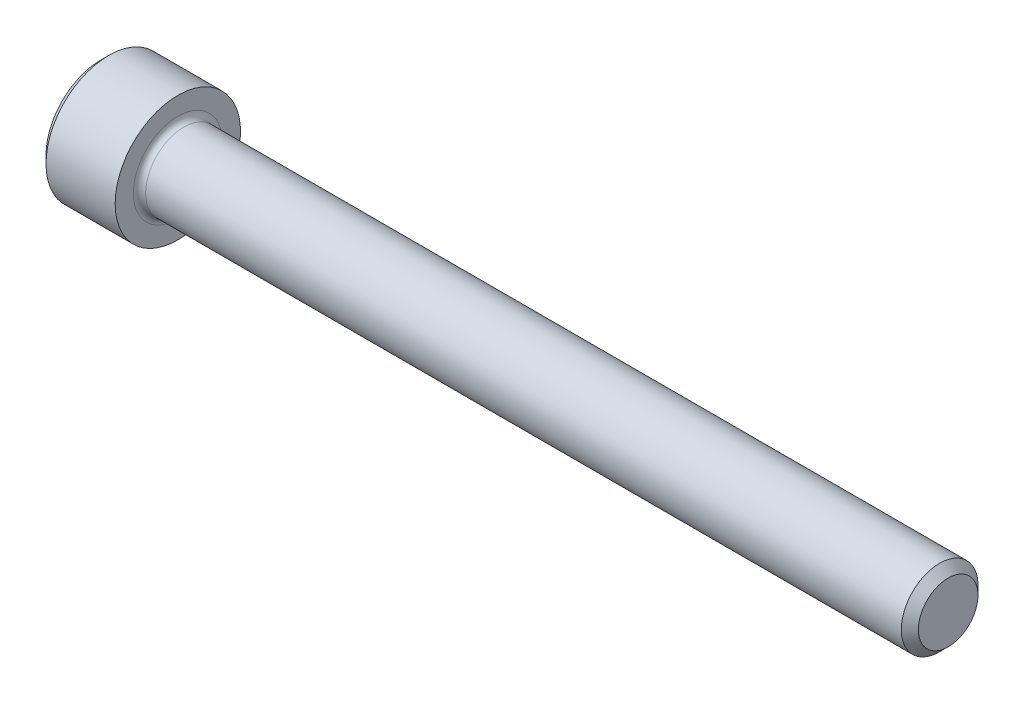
ISO-10303-21;
HEADER;
FILE_DESCRIPTION(('STEP AP214'),'2;1');
FILE_NAME('part.step','',(''),(''),'','','');
FILE_SCHEMA(('AUTOMOTIVE_DESIGN { 1 0 10303 214 1 1 1 1 }'));
ENDSEC;
DATA;
#1=APPLICATION_CONTEXT('core data for automotive mechanical design processes');
#2=APPLICATION_PROTOCOL_DEFINITION('international standard','automotive_design',2000,#1);
#3=PRODUCT_CONTEXT('',#1,'mechanical');
#4=PRODUCT('Part','Part','',(#3));
#5=PRODUCT_RELATED_PRODUCT_CATEGORY('part','',(#4));
#6=PRODUCT_DEFINITION_FORMATION('','',#4);
#7=PRODUCT_DEFINITION_CONTEXT('part definition',#1,'design');
#8=PRODUCT_DEFINITION('design','',#6,#7);
#9=PRODUCT_DEFINITION_SHAPE('','',#8);
#10=(LENGTH_UNIT() NAMED_UNIT(*) SI_UNIT(.MILLI.,.METRE.));
#11=(NAMED_UNIT(*) PLANE_ANGLE_UNIT() SI_UNIT($,.RADIAN.));
#12=(NAMED_UNIT(*) SI_UNIT($,.STERADIAN.) SOLID_ANGLE_UNIT());
#13=UNCERTAINTY_MEASURE_WITH_UNIT(LENGTH_MEASURE(1.E-05),#10,'distance_accuracy_value','');
#14=(GEOMETRIC_REPRESENTATION_CONTEXT(3) GLOBAL_UNCERTAINTY_ASSIGNED_CONTEXT((#13)) GLOBAL_UNIT_ASSIGNED_CONTEXT((#10,
#11,#12)) REPRESENTATION_CONTEXT('',''));
#15=CARTESIAN_POINT('',(0.,0.,0.));
#16=DIRECTION('',(0.,0.,1.));
#17=DIRECTION('',(1.,0.,0.));
#18=AXIS2_PLACEMENT_3D('',#15,#16,#17);
#19=CARTESIAN_POINT('',(0.,0.,0.));
#20=DIRECTION('',(-1.,0.,0.));
#21=DIRECTION('',(0.,0.,1.));
#22=AXIS2_PLACEMENT_3D('',#19,#20,#21);
#23=PLANE('',#22);
#24=DIRECTION('',(0.,-0.499999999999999,0.866025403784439));
#25=VECTOR('',#24,1.);
#26=CARTESIAN_POINT('',(0.,1.37848150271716,0.));
#27=LINE('',#26,#25);
#28=CARTESIAN_POINT('',(0.,1.37848150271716,0.));
#29=VERTEX_POINT('',#28);
#30=CARTESIAN_POINT('',(0.,0.689240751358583,1.1938));
#31=VERTEX_POINT('',#30);
#32=EDGE_CURVE('E258',#29,#31,#27,.T.);
#33=ORIENTED_EDGE('',*,*,#32,.T.);
#34=DIRECTION('',(0.,1.,0.));
#35=VECTOR('',#34,1.);
#36=CARTESIAN_POINT('',(0.,-0.689240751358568,1.1938));
#37=LINE('',#36,#35);
#38=CARTESIAN_POINT('',(0.,-0.689240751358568,1.1938));
#39=VERTEX_POINT('',#38);
#40=EDGE_CURVE('E129',#39,#31,#37,.T.);
#41=ORIENTED_EDGE('',*,*,#40,.F.);
#42=DIRECTION('',(0.,-0.500000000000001,-0.866025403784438));
#43=VECTOR('',#42,1.);
#44=CARTESIAN_POINT('',(0.,-0.689240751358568,1.1938));
#45=LINE('',#44,#43);
#46=CARTESIAN_POINT('',(0.,-1.37848150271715,0.));
#47=VERTEX_POINT('',#46);
#48=EDGE_CURVE('E261',#39,#47,#45,.T.);
#49=ORIENTED_EDGE('',*,*,#48,.T.);
#50=DIRECTION('',(0.,0.499999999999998,-0.86602540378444));
#51=VECTOR('',#50,1.);
#52=CARTESIAN_POINT('',(0.,-1.37848150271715,0.));
#53=LINE('',#52,#51);
#54=CARTESIAN_POINT('',(0.,-0.689240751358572,-1.1938));
#55=VERTEX_POINT('',#54);
#56=EDGE_CURVE('E264',#47,#55,#53,.T.);
#57=ORIENTED_EDGE('',*,*,#56,.T.);
#58=DIRECTION('',(0.,-1.,0.));
#59=VECTOR('',#58,1.);
#60=CARTESIAN_POINT('',(0.,0.689240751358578,-1.1938));
#61=LINE('',#60,#59);
#62=CARTESIAN_POINT('',(0.,0.689240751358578,-1.1938));
#63=VERTEX_POINT('',#62);
#64=EDGE_CURVE('E267',#63,#55,#61,.T.);
#65=ORIENTED_EDGE('',*,*,#64,.F.);
#66=DIRECTION('',(0.,-0.500000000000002,-0.866025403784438));
#67=VECTOR('',#66,1.);
#68=CARTESIAN_POINT('',(0.,1.37848150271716,0.));
#69=LINE('',#68,#67);
#70=EDGE_CURVE('E124',#29,#63,#69,.T.);
#71=ORIENTED_EDGE('',*,*,#70,.F.);
#72=EDGE_LOOP('',(#33,#41,#49,#57,#65,#71));
#73=FACE_BOUND('',#72,.T.);
#74=CARTESIAN_POINT('',(0.,0.,0.));
#75=DIRECTION('',(-1.,0.,0.));
#76=DIRECTION('',(0.,0.,1.));
#77=AXIS2_PLACEMENT_3D('',#74,#75,#76);
#78=CIRCLE('',#77,2.0447);
#79=CARTESIAN_POINT('',(0.,0.,2.0447));
#80=VERTEX_POINT('',#79);
#81=EDGE_CURVE('E153',#80,#80,#78,.T.);
#82=ORIENTED_EDGE('',*,*,#81,.T.);
#83=EDGE_LOOP('',(#82));
#84=FACE_BOUND('',#83,.T.);
#85=ADVANCED_FACE('F33',(#73,#84),#23,.T.);
#86=CARTESIAN_POINT('',(0.,0.,0.));
#87=DIRECTION('',(1.,0.,0.));
#88=DIRECTION('',(0.,0.,-1.));
#89=AXIS2_PLACEMENT_3D('',#86,#87,#88);
#90=CONICAL_SURFACE('',#89,2.0447,0.785398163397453);
#91=CARTESIAN_POINT('',(0.279399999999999,0.,0.));
#92=DIRECTION('',(-1.,0.,0.));
#93=DIRECTION('',(0.,0.,1.));
#94=AXIS2_PLACEMENT_3D('',#91,#92,#93);
#95=CIRCLE('',#94,2.3241);
#96=CARTESIAN_POINT('',(0.279399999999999,0.,2.3241));
#97=VERTEX_POINT('',#96);
#98=EDGE_CURVE('E150',#97,#97,#95,.T.);
#99=ORIENTED_EDGE('',*,*,#98,.T.);
#100=EDGE_LOOP('',(#99));
#101=FACE_BOUND('',#100,.T.);
#102=ORIENTED_EDGE('',*,*,#81,.F.);
#103=EDGE_LOOP('',(#102));
#104=FACE_BOUND('',#103,.T.);
#105=ADVANCED_FACE('F174',(#101,#104),#90,.T.);
#106=CARTESIAN_POINT('',(-31.75,0.,0.));
#107=DIRECTION('',(-1.,0.,0.));
#108=DIRECTION('',(0.,0.,1.));
#109=AXIS2_PLACEMENT_3D('',#106,#107,#108);
#110=CYLINDRICAL_SURFACE('',#109,2.3241);
#111=CARTESIAN_POINT('',(2.8448,0.,0.));
#112=DIRECTION('',(-1.,0.,0.));
#113=DIRECTION('',(0.,0.,1.));
#114=AXIS2_PLACEMENT_3D('',#111,#112,#113);
#115=CIRCLE('',#114,2.3241);
#116=CARTESIAN_POINT('',(2.8448,0.,2.3241));
#117=VERTEX_POINT('',#116);
#118=EDGE_CURVE('E147',#117,#117,#115,.T.);
#119=ORIENTED_EDGE('',*,*,#118,.T.);
#120=EDGE_LOOP('',(#119));
#121=FACE_BOUND('',#120,.T.);
#122=ORIENTED_EDGE('',*,*,#98,.F.);
#123=EDGE_LOOP('',(#122));
#124=FACE_BOUND('',#123,.T.);
#125=ADVANCED_FACE('F179',(#121,#124),#110,.T.);
#126=CARTESIAN_POINT('',(2.8448,2.3241,0.));
#127=DIRECTION('',(1.,0.,0.));
#128=DIRECTION('',(0.,0.,-1.));
#129=AXIS2_PLACEMENT_3D('',#126,#127,#128);
#130=PLANE('',#129);
#131=CARTESIAN_POINT('',(2.8448,0.,0.));
#132=DIRECTION('',(1.,0.,0.));
#133=DIRECTION('',(0.,0.,-1.));
#134=AXIS2_PLACEMENT_3D('',#131,#132,#133);
#135=CIRCLE('',#134,1.651);
#136=CARTESIAN_POINT('',(2.8448,0.,-1.651));
#137=VERTEX_POINT('',#136);
#138=EDGE_CURVE('E41',#137,#137,#135,.F.);
#139=ORIENTED_EDGE('',*,*,#138,.T.);
#140=EDGE_LOOP('',(#139));
#141=FACE_BOUND('',#140,.T.);
#142=ORIENTED_EDGE('',*,*,#118,.F.);
#143=EDGE_LOOP('',(#142));
#144=FACE_BOUND('',#143,.T.);
#145=ADVANCED_FACE('F158',(#141,#144),#130,.T.);
#146=CARTESIAN_POINT('',(-31.75,0.,0.));
#147=DIRECTION('',(-1.,0.,0.));
#148=DIRECTION('',(0.,0.,1.));
#149=AXIS2_PLACEMENT_3D('',#146,#147,#148);
#150=CYLINDRICAL_SURFACE('',#149,1.4224);
#151=CARTESIAN_POINT('',(3.0734,0.,0.));
#152=DIRECTION('',(1.,0.,0.));
#153=DIRECTION('',(0.,0.,-1.));
#154=AXIS2_PLACEMENT_3D('',#151,#152,#153);
#155=CIRCLE('',#154,1.4224);
#156=CARTESIAN_POINT('',(3.0734,0.,-1.4224));
#157=VERTEX_POINT('',#156);
#158=EDGE_CURVE('E11',#157,#157,#155,.T.);
#159=ORIENTED_EDGE('',*,*,#158,.T.);
#160=EDGE_LOOP('',(#159));
#161=FACE_BOUND('',#160,.T.);
#162=CARTESIAN_POINT('',(31.10357,0.,0.));
#163=DIRECTION('',(-1.,0.,0.));
#164=DIRECTION('',(0.,0.,1.));
#165=AXIS2_PLACEMENT_3D('',#162,#163,#164);
#166=CIRCLE('',#165,1.4224);
#167=CARTESIAN_POINT('',(31.10357,0.,1.4224));
#168=VERTEX_POINT('',#167);
#169=EDGE_CURVE('E144',#168,#168,#166,.T.);
#170=ORIENTED_EDGE('',*,*,#169,.T.);
#171=EDGE_LOOP('',(#170));
#172=FACE_BOUND('',#171,.T.);
#173=ADVANCED_FACE('F189',(#161,#172),#150,.T.);
#174=CARTESIAN_POINT('',(31.4198,0.,0.));
#175=DIRECTION('',(-1.,0.,0.));
#176=DIRECTION('',(0.,0.,1.));
#177=AXIS2_PLACEMENT_3D('',#174,#175,#176);
#178=CONICAL_SURFACE('',#177,1.10617,0.785398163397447);
#179=ORIENTED_EDGE('',*,*,#169,.F.);
#180=EDGE_LOOP('',(#179));
#181=FACE_BOUND('',#180,.T.);
#182=CARTESIAN_POINT('',(31.4198,0.,0.));
#183=DIRECTION('',(-1.,0.,0.));
#184=DIRECTION('',(0.,0.,1.));
#185=AXIS2_PLACEMENT_3D('',#182,#183,#184);
#186=CIRCLE('',#185,1.10617);
#187=CARTESIAN_POINT('',(31.4198,0.,1.10617));
#188=VERTEX_POINT('',#187);
#189=EDGE_CURVE('E140',#188,#188,#186,.T.);
#190=ORIENTED_EDGE('',*,*,#189,.T.);
#191=EDGE_LOOP('',(#190));
#192=FACE_BOUND('',#191,.T.);
#193=ADVANCED_FACE('F169',(#181,#192),#178,.T.);
#194=CARTESIAN_POINT('',(31.4198,1.10617,0.));
#195=DIRECTION('',(1.,0.,0.));
#196=DIRECTION('',(0.,0.,-1.));
#197=AXIS2_PLACEMENT_3D('',#194,#195,#196);
#198=PLANE('',#197);
#199=ORIENTED_EDGE('',*,*,#189,.F.);
#200=EDGE_LOOP('',(#199));
#201=FACE_BOUND('',#200,.T.);
#202=ADVANCED_FACE('F162',(#201),#198,.T.);
#203=CARTESIAN_POINT('',(3.0734,0.,0.));
#204=DIRECTION('',(1.,0.,0.));
#205=DIRECTION('',(0.,0.,-1.));
#206=AXIS2_PLACEMENT_3D('',#203,#204,#205);
#207=TOROIDAL_SURFACE('',#206,1.651,0.2286);
#208=ORIENTED_EDGE('',*,*,#158,.F.);
#209=EDGE_LOOP('',(#208));
#210=FACE_BOUND('',#209,.T.);
#211=ORIENTED_EDGE('',*,*,#138,.F.);
#212=EDGE_LOOP('',(#211));
#213=FACE_BOUND('',#212,.T.);
#214=ADVANCED_FACE('F35',(#210,#213),#207,.F.);
#215=CARTESIAN_POINT('',(1.2954,1.37848150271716,0.));
#216=DIRECTION('',(0.,-0.866025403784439,-0.499999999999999));
#217=DIRECTION('',(0.,0.499999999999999,-0.866025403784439));
#218=AXIS2_PLACEMENT_3D('',#215,#216,#217);
#219=PLANE('',#218);
#220=ORIENTED_EDGE('',*,*,#32,.F.);
#221=DIRECTION('',(-1.,0.,0.));
#222=VECTOR('',#221,1.);
#223=CARTESIAN_POINT('',(1.2954,1.37848150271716,0.));
#224=LINE('',#223,#222);
#225=CARTESIAN_POINT('',(1.2954,1.37848150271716,0.));
#226=VERTEX_POINT('',#225);
#227=EDGE_CURVE('E248',#226,#29,#224,.T.);
#228=ORIENTED_EDGE('',*,*,#227,.F.);
#229=DIRECTION('',(0.,-0.499999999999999,0.866025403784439));
#230=VECTOR('',#229,1.);
#231=CARTESIAN_POINT('',(1.2954,1.37848150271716,0.));
#232=LINE('',#231,#230);
#233=CARTESIAN_POINT('',(1.2954,1.03386112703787,0.5969));
#234=VERTEX_POINT('',#233);
#235=EDGE_CURVE('E116',#226,#234,#232,.T.);
#236=ORIENTED_EDGE('',*,*,#235,.T.);
#237=CARTESIAN_POINT('',(1.2954,0.689240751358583,1.1938));
#238=VERTEX_POINT('',#237);
#239=EDGE_CURVE('E107',#234,#238,#232,.T.);
#240=ORIENTED_EDGE('',*,*,#239,.T.);
#241=DIRECTION('',(-1.,0.,0.));
#242=VECTOR('',#241,1.);
#243=CARTESIAN_POINT('',(1.2954,0.689240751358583,1.1938));
#244=LINE('',#243,#242);
#245=EDGE_CURVE('E121',#238,#31,#244,.T.);
#246=ORIENTED_EDGE('',*,*,#245,.T.);
#247=EDGE_LOOP('',(#220,#228,#236,#240,#246));
#248=FACE_BOUND('',#247,.T.);
#249=ADVANCED_FACE('F120',(#248),#219,.T.);
#250=CARTESIAN_POINT('',(1.2954,-0.689240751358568,1.1938));
#251=DIRECTION('',(0.,0.,1.));
#252=DIRECTION('',(0.,-1.,0.));
#253=AXIS2_PLACEMENT_3D('',#250,#251,#252);
#254=PLANE('',#253);
#255=ORIENTED_EDGE('',*,*,#40,.T.);
#256=ORIENTED_EDGE('',*,*,#245,.F.);
#257=DIRECTION('',(0.,1.,0.));
#258=VECTOR('',#257,1.);
#259=CARTESIAN_POINT('',(1.2954,-0.689240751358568,1.1938));
#260=LINE('',#259,#258);
#261=CARTESIAN_POINT('',(1.2954,0.,1.1938));
#262=VERTEX_POINT('',#261);
#263=EDGE_CURVE('E104',#262,#238,#260,.T.);
#264=ORIENTED_EDGE('',*,*,#263,.F.);
#265=CARTESIAN_POINT('',(1.2954,-0.689240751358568,1.1938));
#266=VERTEX_POINT('',#265);
#267=EDGE_CURVE('E115',#266,#262,#260,.T.);
#268=ORIENTED_EDGE('',*,*,#267,.F.);
#269=DIRECTION('',(-1.,0.,0.));
#270=VECTOR('',#269,1.);
#271=CARTESIAN_POINT('',(1.2954,-0.689240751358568,1.1938));
#272=LINE('',#271,#270);
#273=EDGE_CURVE('E131',#266,#39,#272,.T.);
#274=ORIENTED_EDGE('',*,*,#273,.T.);
#275=EDGE_LOOP('',(#255,#256,#264,#268,#274));
#276=FACE_BOUND('',#275,.T.);
#277=ADVANCED_FACE('F126',(#276),#254,.F.);
#278=CARTESIAN_POINT('',(1.2954,-0.689240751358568,1.1938));
#279=DIRECTION('',(0.,0.866025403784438,-0.500000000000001));
#280=DIRECTION('',(0.,0.500000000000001,0.866025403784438));
#281=AXIS2_PLACEMENT_3D('',#278,#279,#280);
#282=PLANE('',#281);
#283=ORIENTED_EDGE('',*,*,#48,.F.);
#284=ORIENTED_EDGE('',*,*,#273,.F.);
#285=DIRECTION('',(0.,-0.500000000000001,-0.866025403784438));
#286=VECTOR('',#285,1.);
#287=CARTESIAN_POINT('',(1.2954,-0.689240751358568,1.1938));
#288=LINE('',#287,#286);
#289=CARTESIAN_POINT('',(1.2954,-1.03386112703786,0.596899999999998));
#290=VERTEX_POINT('',#289);
#291=EDGE_CURVE('E287',#266,#290,#288,.T.);
#292=ORIENTED_EDGE('',*,*,#291,.T.);
#293=CARTESIAN_POINT('',(1.2954,-1.37848150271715,0.));
#294=VERTEX_POINT('',#293);
#295=EDGE_CURVE('E276',#290,#294,#288,.T.);
#296=ORIENTED_EDGE('',*,*,#295,.T.);
#297=DIRECTION('',(-1.,0.,0.));
#298=VECTOR('',#297,1.);
#299=CARTESIAN_POINT('',(1.2954,-1.37848150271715,0.));
#300=LINE('',#299,#298);
#301=EDGE_CURVE('E136',#294,#47,#300,.T.);
#302=ORIENTED_EDGE('',*,*,#301,.T.);
#303=EDGE_LOOP('',(#283,#284,#292,#296,#302));
#304=FACE_BOUND('',#303,.T.);
#305=ADVANCED_FACE('F202',(#304),#282,.T.);
#306=CARTESIAN_POINT('',(1.2954,-1.37848150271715,0.));
#307=DIRECTION('',(0.,0.86602540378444,0.499999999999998));
#308=DIRECTION('',(0.,-0.499999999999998,0.86602540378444));
#309=AXIS2_PLACEMENT_3D('',#306,#307,#308);
#310=PLANE('',#309);
#311=ORIENTED_EDGE('',*,*,#56,.F.);
#312=ORIENTED_EDGE('',*,*,#301,.F.);
#313=DIRECTION('',(0.,0.499999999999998,-0.86602540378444));
#314=VECTOR('',#313,1.);
#315=CARTESIAN_POINT('',(1.2954,-1.37848150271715,0.));
#316=LINE('',#315,#314);
#317=CARTESIAN_POINT('',(1.2954,-1.03386112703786,-0.596899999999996));
#318=VERTEX_POINT('',#317);
#319=EDGE_CURVE('E254',#294,#318,#316,.T.);
#320=ORIENTED_EDGE('',*,*,#319,.T.);
#321=CARTESIAN_POINT('',(1.2954,-0.689240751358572,-1.1938));
#322=VERTEX_POINT('',#321);
#323=EDGE_CURVE('E286',#318,#322,#316,.T.);
#324=ORIENTED_EDGE('',*,*,#323,.T.);
#325=DIRECTION('',(-1.,0.,0.));
#326=VECTOR('',#325,1.);
#327=CARTESIAN_POINT('',(1.2954,-0.689240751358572,-1.1938));
#328=LINE('',#327,#326);
#329=EDGE_CURVE('E247',#322,#55,#328,.T.);
#330=ORIENTED_EDGE('',*,*,#329,.T.);
#331=EDGE_LOOP('',(#311,#312,#320,#324,#330));
#332=FACE_BOUND('',#331,.T.);
#333=ADVANCED_FACE('F205',(#332),#310,.T.);
#334=CARTESIAN_POINT('',(1.2954,0.689240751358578,-1.1938));
#335=DIRECTION('',(0.,0.,-1.));
#336=DIRECTION('',(0.,1.,0.));
#337=AXIS2_PLACEMENT_3D('',#334,#335,#336);
#338=PLANE('',#337);
#339=ORIENTED_EDGE('',*,*,#64,.T.);
#340=ORIENTED_EDGE('',*,*,#329,.F.);
#341=DIRECTION('',(0.,-1.,0.));
#342=VECTOR('',#341,1.);
#343=CARTESIAN_POINT('',(1.2954,0.689240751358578,-1.1938));
#344=LINE('',#343,#342);
#345=CARTESIAN_POINT('',(1.2954,0.,-1.1938));
#346=VERTEX_POINT('',#345);
#347=EDGE_CURVE('E251',#346,#322,#344,.T.);
#348=ORIENTED_EDGE('',*,*,#347,.F.);
#349=CARTESIAN_POINT('',(1.2954,0.689240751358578,-1.1938));
#350=VERTEX_POINT('',#349);
#351=EDGE_CURVE('E48',#350,#346,#344,.T.);
#352=ORIENTED_EDGE('',*,*,#351,.F.);
#353=DIRECTION('',(-1.,0.,0.));
#354=VECTOR('',#353,1.);
#355=CARTESIAN_POINT('',(1.2954,0.689240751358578,-1.1938));
#356=LINE('',#355,#354);
#357=EDGE_CURVE('E244',#350,#63,#356,.T.);
#358=ORIENTED_EDGE('',*,*,#357,.T.);
#359=EDGE_LOOP('',(#339,#340,#348,#352,#358));
#360=FACE_BOUND('',#359,.T.);
#361=ADVANCED_FACE('F209',(#360),#338,.F.);
#362=CARTESIAN_POINT('',(1.2954,1.37848150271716,0.));
#363=DIRECTION('',(0.,0.866025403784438,-0.500000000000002));
#364=DIRECTION('',(0.,0.500000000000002,0.866025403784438));
#365=AXIS2_PLACEMENT_3D('',#362,#363,#364);
#366=PLANE('',#365);
#367=ORIENTED_EDGE('',*,*,#70,.T.);
#368=ORIENTED_EDGE('',*,*,#357,.F.);
#369=DIRECTION('',(0.,-0.500000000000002,-0.866025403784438));
#370=VECTOR('',#369,1.);
#371=CARTESIAN_POINT('',(1.2954,1.37848150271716,0.));
#372=LINE('',#371,#370);
#373=CARTESIAN_POINT('',(1.2954,1.03386112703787,-0.596900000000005));
#374=VERTEX_POINT('',#373);
#375=EDGE_CURVE('E234',#374,#350,#372,.T.);
#376=ORIENTED_EDGE('',*,*,#375,.F.);
#377=EDGE_CURVE('E240',#226,#374,#372,.T.);
#378=ORIENTED_EDGE('',*,*,#377,.F.);
#379=ORIENTED_EDGE('',*,*,#227,.T.);
#380=EDGE_LOOP('',(#367,#368,#376,#378,#379));
#381=FACE_BOUND('',#380,.T.);
#382=ADVANCED_FACE('F213',(#381),#366,.F.);
#383=CARTESIAN_POINT('',(1.2954,2.06772225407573,-1.1938));
#384=DIRECTION('',(1.,0.,0.));
#385=DIRECTION('',(0.,0.,-1.));
#386=AXIS2_PLACEMENT_3D('',#383,#384,#385);
#387=PLANE('',#386);
#388=ORIENTED_EDGE('',*,*,#347,.T.);
#389=ORIENTED_EDGE('',*,*,#323,.F.);
#390=CARTESIAN_POINT('',(1.2954,0.,0.));
#391=DIRECTION('',(-1.,0.,0.));
#392=DIRECTION('',(0.,0.,1.));
#393=AXIS2_PLACEMENT_3D('',#390,#391,#392);
#394=CIRCLE('',#393,1.1938);
#395=EDGE_CURVE('E282',#346,#318,#394,.T.);
#396=ORIENTED_EDGE('',*,*,#395,.F.);
#397=EDGE_LOOP('',(#388,#389,#396));
#398=FACE_BOUND('',#397,.T.);
#399=ADVANCED_FACE('F217',(#398),#387,.F.);
#400=ORIENTED_EDGE('',*,*,#319,.F.);
#401=ORIENTED_EDGE('',*,*,#295,.F.);
#402=EDGE_CURVE('E134',#318,#290,#394,.T.);
#403=ORIENTED_EDGE('',*,*,#402,.F.);
#404=EDGE_LOOP('',(#400,#401,#403));
#405=FACE_BOUND('',#404,.T.);
#406=ADVANCED_FACE('F220',(#405),#387,.F.);
#407=ORIENTED_EDGE('',*,*,#291,.F.);
#408=ORIENTED_EDGE('',*,*,#267,.T.);
#409=EDGE_CURVE('E130',#290,#262,#394,.T.);
#410=ORIENTED_EDGE('',*,*,#409,.F.);
#411=EDGE_LOOP('',(#407,#408,#410));
#412=FACE_BOUND('',#411,.T.);
#413=ADVANCED_FACE('F225',(#412),#387,.F.);
#414=ORIENTED_EDGE('',*,*,#263,.T.);
#415=ORIENTED_EDGE('',*,*,#239,.F.);
#416=EDGE_CURVE('E110',#262,#234,#394,.T.);
#417=ORIENTED_EDGE('',*,*,#416,.F.);
#418=EDGE_LOOP('',(#414,#415,#417));
#419=FACE_BOUND('',#418,.T.);
#420=ADVANCED_FACE('F106',(#419),#387,.F.);
#421=ORIENTED_EDGE('',*,*,#235,.F.);
#422=ORIENTED_EDGE('',*,*,#377,.T.);
#423=EDGE_CURVE('E141',#234,#374,#394,.T.);
#424=ORIENTED_EDGE('',*,*,#423,.F.);
#425=EDGE_LOOP('',(#421,#422,#424));
#426=FACE_BOUND('',#425,.T.);
#427=ADVANCED_FACE('F228',(#426),#387,.F.);
#428=ORIENTED_EDGE('',*,*,#375,.T.);
#429=ORIENTED_EDGE('',*,*,#351,.T.);
#430=EDGE_CURVE('E237',#374,#346,#394,.T.);
#431=ORIENTED_EDGE('',*,*,#430,.F.);
#432=EDGE_LOOP('',(#428,#429,#431));
#433=FACE_BOUND('',#432,.T.);
#434=ADVANCED_FACE('F198',(#433),#387,.F.);
#435=CARTESIAN_POINT('',(1.2954,0.,0.));
#436=DIRECTION('',(-1.,0.,0.));
#437=DIRECTION('',(0.,0.,1.));
#438=AXIS2_PLACEMENT_3D('',#435,#436,#437);
#439=CONICAL_SURFACE('',#438,1.1938,1.04719755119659);
#440=CARTESIAN_POINT('',(1.98464075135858,0.,0.));
#441=VERTEX_POINT('',#440);
#442=VERTEX_LOOP('',#441);
#443=FACE_BOUND('',#442,.T.);
#444=ORIENTED_EDGE('',*,*,#416,.T.);
#445=ORIENTED_EDGE('',*,*,#423,.T.);
#446=ORIENTED_EDGE('',*,*,#430,.T.);
#447=ORIENTED_EDGE('',*,*,#395,.T.);
#448=ORIENTED_EDGE('',*,*,#402,.T.);
#449=ORIENTED_EDGE('',*,*,#409,.T.);
#450=EDGE_LOOP('',(#444,#445,#446,#447,#448,#449));
#451=FACE_BOUND('',#450,.T.);
#452=ADVANCED_FACE('F196',(#443,#451),#439,.F.);
#453=CLOSED_SHELL('',(#85,#105,#125,#145,#173,#193,#202,#214,#249,#277,#305,#333,#361,#382,#399,
#406,#413,#420,#427,#434,#452));
#454=MANIFOLD_SOLID_BREP('B2',#453);
#455=ADVANCED_BREP_SHAPE_REPRESENTATION('',(#18,#454),#14);
#456=SHAPE_DEFINITION_REPRESENTATION(#9,#455);
ENDSEC;
END-ISO-10303-21;
